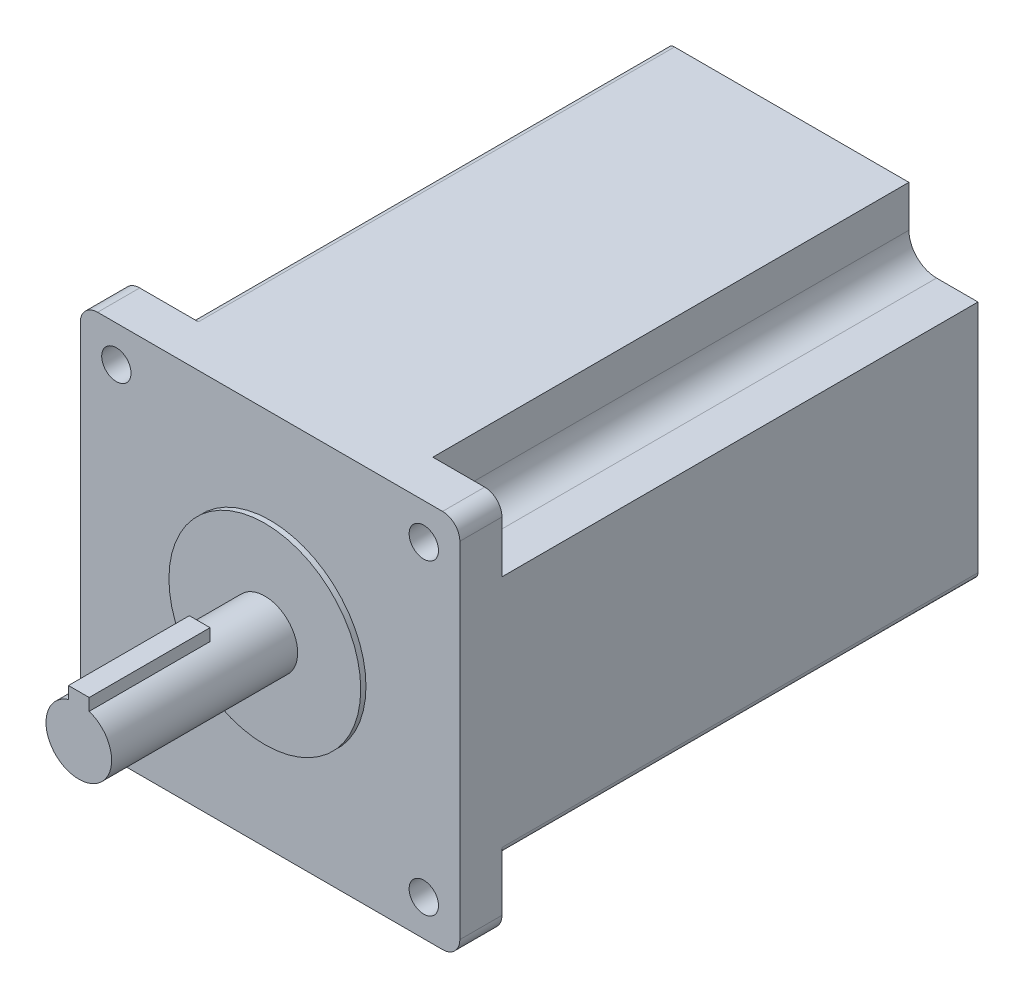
ISO-10303-21;
HEADER;
FILE_DESCRIPTION(('STEP AP214'),'2;1');
FILE_NAME('part.step','',(''),(''),'','','');
FILE_SCHEMA(('AUTOMOTIVE_DESIGN { 1 0 10303 214 1 1 1 1 }'));
ENDSEC;
DATA;
#1=APPLICATION_CONTEXT('core data for automotive mechanical design processes');
#2=APPLICATION_PROTOCOL_DEFINITION('international standard','automotive_design',2000,#1);
#3=PRODUCT_CONTEXT('',#1,'mechanical');
#4=PRODUCT('Part','Part','',(#3));
#5=PRODUCT_RELATED_PRODUCT_CATEGORY('part','',(#4));
#6=PRODUCT_DEFINITION_FORMATION('','',#4);
#7=PRODUCT_DEFINITION_CONTEXT('part definition',#1,'design');
#8=PRODUCT_DEFINITION('design','',#6,#7);
#9=PRODUCT_DEFINITION_SHAPE('','',#8);
#10=(LENGTH_UNIT() NAMED_UNIT(*) SI_UNIT(.MILLI.,.METRE.));
#11=(NAMED_UNIT(*) PLANE_ANGLE_UNIT() SI_UNIT($,.RADIAN.));
#12=(NAMED_UNIT(*) SI_UNIT($,.STERADIAN.) SOLID_ANGLE_UNIT());
#13=UNCERTAINTY_MEASURE_WITH_UNIT(LENGTH_MEASURE(1.E-05),#10,'distance_accuracy_value','');
#14=(GEOMETRIC_REPRESENTATION_CONTEXT(3) GLOBAL_UNCERTAINTY_ASSIGNED_CONTEXT((#13)) GLOBAL_UNIT_ASSIGNED_CONTEXT((#10,
#11,#12)) REPRESENTATION_CONTEXT('',''));
#15=CARTESIAN_POINT('',(0.,0.,0.));
#16=DIRECTION('',(0.,0.,1.));
#17=DIRECTION('',(1.,0.,0.));
#18=AXIS2_PLACEMENT_3D('',#15,#16,#17);
#19=CARTESIAN_POINT('',(29.0269690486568,-33.0397914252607,151.52));
#20=DIRECTION('',(0.,0.,1.));
#21=DIRECTION('',(1.,0.,0.));
#22=AXIS2_PLACEMENT_3D('',#19,#20,#21);
#23=PLANE('',#22);
#24=CARTESIAN_POINT('',(29.0269690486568,-33.0397914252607,151.52));
#25=DIRECTION('',(0.,0.,1.));
#26=DIRECTION('',(1.,0.,0.));
#27=AXIS2_PLACEMENT_3D('',#24,#25,#26);
#28=CIRCLE('',#27,27.76);
#29=CARTESIAN_POINT('',(56.7869690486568,-33.0397914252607,151.52));
#30=VERTEX_POINT('',#29);
#31=EDGE_CURVE('E298',#30,#30,#28,.T.);
#32=ORIENTED_EDGE('',*,*,#31,.T.);
#33=EDGE_LOOP('',(#32));
#34=FACE_BOUND('',#33,.T.);
#35=CARTESIAN_POINT('',(29.0269690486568,-33.0397914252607,151.52));
#36=DIRECTION('',(0.,0.,1.));
#37=DIRECTION('',(1.,0.,0.));
#38=AXIS2_PLACEMENT_3D('',#35,#36,#37);
#39=CIRCLE('',#38,9.5);
#40=CARTESIAN_POINT('',(38.5269690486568,-33.0397914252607,151.52));
#41=VERTEX_POINT('',#40);
#42=EDGE_CURVE('E291',#41,#41,#39,.T.);
#43=ORIENTED_EDGE('',*,*,#42,.F.);
#44=EDGE_LOOP('',(#43));
#45=FACE_BOUND('',#44,.T.);
#46=ADVANCED_FACE('F31',(#34,#45),#23,.T.);
#47=CARTESIAN_POINT('',(-25.9030309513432,-87.9697914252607,150.));
#48=DIRECTION('',(0.,0.,1.));
#49=DIRECTION('',(1.,0.,0.));
#50=AXIS2_PLACEMENT_3D('',#47,#48,#49);
#51=PLANE('',#50);
#52=CARTESIAN_POINT('',(73.5269690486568,-77.5397914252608,150.));
#53=DIRECTION('',(0.,0.,1.));
#54=DIRECTION('',(1.,0.,0.));
#55=AXIS2_PLACEMENT_3D('',#52,#53,#54);
#56=CIRCLE('',#55,4.25000000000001);
#57=CARTESIAN_POINT('',(77.7769690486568,-77.5397914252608,150.));
#58=VERTEX_POINT('',#57);
#59=EDGE_CURVE('E544',#58,#58,#56,.T.);
#60=ORIENTED_EDGE('',*,*,#59,.F.);
#61=EDGE_LOOP('',(#60));
#62=FACE_BOUND('',#61,.T.);
#63=CARTESIAN_POINT('',(-15.4730309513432,-77.5397914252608,150.));
#64=DIRECTION('',(0.,0.,1.));
#65=DIRECTION('',(1.,0.,0.));
#66=AXIS2_PLACEMENT_3D('',#63,#64,#65);
#67=CIRCLE('',#66,4.25);
#68=CARTESIAN_POINT('',(-11.2230309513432,-77.5397914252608,150.));
#69=VERTEX_POINT('',#68);
#70=EDGE_CURVE('E534',#69,#69,#67,.T.);
#71=ORIENTED_EDGE('',*,*,#70,.F.);
#72=EDGE_LOOP('',(#71));
#73=FACE_BOUND('',#72,.T.);
#74=CARTESIAN_POINT('',(73.5269690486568,11.4602085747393,150.));
#75=DIRECTION('',(0.,0.,1.));
#76=DIRECTION('',(1.,0.,0.));
#77=AXIS2_PLACEMENT_3D('',#74,#75,#76);
#78=CIRCLE('',#77,4.25000000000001);
#79=CARTESIAN_POINT('',(77.7769690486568,11.4602085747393,150.));
#80=VERTEX_POINT('',#79);
#81=EDGE_CURVE('E531',#80,#80,#78,.T.);
#82=ORIENTED_EDGE('',*,*,#81,.F.);
#83=EDGE_LOOP('',(#82));
#84=FACE_BOUND('',#83,.T.);
#85=CARTESIAN_POINT('',(-15.4730309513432,11.4602085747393,150.));
#86=DIRECTION('',(0.,0.,1.));
#87=DIRECTION('',(1.,0.,0.));
#88=AXIS2_PLACEMENT_3D('',#85,#86,#87);
#89=CIRCLE('',#88,4.25);
#90=CARTESIAN_POINT('',(-11.2230309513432,11.4602085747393,150.));
#91=VERTEX_POINT('',#90);
#92=EDGE_CURVE('E528',#91,#91,#89,.T.);
#93=ORIENTED_EDGE('',*,*,#92,.F.);
#94=EDGE_LOOP('',(#93));
#95=FACE_BOUND('',#94,.T.);
#96=DIRECTION('',(-1.,0.,0.));
#97=VECTOR('',#96,1.);
#98=CARTESIAN_POINT('',(-25.9030309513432,21.8902085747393,150.));
#99=LINE('',#98,#97);
#100=CARTESIAN_POINT('',(78.9569690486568,21.8902085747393,150.));
#101=VERTEX_POINT('',#100);
#102=CARTESIAN_POINT('',(-20.9030309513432,21.8902085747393,150.));
#103=VERTEX_POINT('',#102);
#104=EDGE_CURVE('E378',#101,#103,#99,.T.);
#105=ORIENTED_EDGE('',*,*,#104,.T.);
#106=CARTESIAN_POINT('',(-20.9030309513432,16.8902085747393,150.));
#107=DIRECTION('',(0.,0.,1.));
#108=DIRECTION('',(1.,0.,0.));
#109=AXIS2_PLACEMENT_3D('',#106,#107,#108);
#110=CIRCLE('',#109,5.);
#111=CARTESIAN_POINT('',(-25.9030309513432,16.8902085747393,150.));
#112=VERTEX_POINT('',#111);
#113=EDGE_CURVE('E410',#103,#112,#110,.T.);
#114=ORIENTED_EDGE('',*,*,#113,.T.);
#115=DIRECTION('',(0.,-1.,0.));
#116=VECTOR('',#115,1.);
#117=CARTESIAN_POINT('',(-25.9030309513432,21.8902085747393,150.));
#118=LINE('',#117,#116);
#119=CARTESIAN_POINT('',(-25.9030309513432,-82.9697914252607,150.));
#120=VERTEX_POINT('',#119);
#121=EDGE_CURVE('E368',#112,#120,#118,.T.);
#122=ORIENTED_EDGE('',*,*,#121,.T.);
#123=CARTESIAN_POINT('',(-20.9030309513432,-82.9697914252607,150.));
#124=DIRECTION('',(0.,0.,1.));
#125=DIRECTION('',(1.,0.,0.));
#126=AXIS2_PLACEMENT_3D('',#123,#124,#125);
#127=CIRCLE('',#126,5.);
#128=CARTESIAN_POINT('',(-20.9030309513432,-87.9697914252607,150.));
#129=VERTEX_POINT('',#128);
#130=EDGE_CURVE('E408',#120,#129,#127,.T.);
#131=ORIENTED_EDGE('',*,*,#130,.T.);
#132=DIRECTION('',(1.,0.,0.));
#133=VECTOR('',#132,1.);
#134=CARTESIAN_POINT('',(-25.9030309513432,-87.9697914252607,150.));
#135=LINE('',#134,#133);
#136=CARTESIAN_POINT('',(78.9569690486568,-87.9697914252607,150.));
#137=VERTEX_POINT('',#136);
#138=EDGE_CURVE('E371',#129,#137,#135,.T.);
#139=ORIENTED_EDGE('',*,*,#138,.T.);
#140=CARTESIAN_POINT('',(78.9569690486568,-82.9697914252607,150.));
#141=DIRECTION('',(0.,0.,1.));
#142=DIRECTION('',(1.,0.,0.));
#143=AXIS2_PLACEMENT_3D('',#140,#141,#142);
#144=CIRCLE('',#143,5.);
#145=CARTESIAN_POINT('',(83.9569690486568,-82.9697914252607,150.));
#146=VERTEX_POINT('',#145);
#147=EDGE_CURVE('E406',#137,#146,#144,.T.);
#148=ORIENTED_EDGE('',*,*,#147,.T.);
#149=DIRECTION('',(0.,1.,0.));
#150=VECTOR('',#149,1.);
#151=CARTESIAN_POINT('',(83.9569690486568,21.8902085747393,150.));
#152=LINE('',#151,#150);
#153=CARTESIAN_POINT('',(83.9569690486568,16.8902085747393,150.));
#154=VERTEX_POINT('',#153);
#155=EDGE_CURVE('E375',#146,#154,#152,.T.);
#156=ORIENTED_EDGE('',*,*,#155,.T.);
#157=CARTESIAN_POINT('',(78.9569690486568,16.8902085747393,150.));
#158=DIRECTION('',(0.,0.,1.));
#159=DIRECTION('',(1.,0.,0.));
#160=AXIS2_PLACEMENT_3D('',#157,#158,#159);
#161=CIRCLE('',#160,5.);
#162=EDGE_CURVE('E404',#154,#101,#161,.T.);
#163=ORIENTED_EDGE('',*,*,#162,.T.);
#164=EDGE_LOOP('',(#105,#114,#122,#131,#139,#148,#156,#163));
#165=FACE_BOUND('',#164,.T.);
#166=CARTESIAN_POINT('',(29.0269690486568,-33.0397914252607,150.));
#167=DIRECTION('',(0.,0.,1.));
#168=DIRECTION('',(1.,0.,0.));
#169=AXIS2_PLACEMENT_3D('',#166,#167,#168);
#170=CIRCLE('',#169,27.76);
#171=CARTESIAN_POINT('',(56.7869690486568,-33.0397914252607,150.));
#172=VERTEX_POINT('',#171);
#173=EDGE_CURVE('E295',#172,#172,#170,.T.);
#174=ORIENTED_EDGE('',*,*,#173,.F.);
#175=EDGE_LOOP('',(#174));
#176=FACE_BOUND('',#175,.T.);
#177=ADVANCED_FACE('F569',(#62,#73,#84,#95,#165,#176),#51,.T.);
#178=CARTESIAN_POINT('',(-25.9030309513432,21.8902085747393,150.));
#179=DIRECTION('',(1.,0.,0.));
#180=DIRECTION('',(0.,0.,-1.));
#181=AXIS2_PLACEMENT_3D('',#178,#179,#180);
#182=PLANE('',#181);
#183=DIRECTION('',(0.,-1.,0.));
#184=VECTOR('',#183,1.);
#185=CARTESIAN_POINT('',(-25.9030309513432,21.8902085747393,0.));
#186=LINE('',#185,#184);
#187=CARTESIAN_POINT('',(-25.9030309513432,-0.109791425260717,0.));
#188=VERTEX_POINT('',#187);
#189=CARTESIAN_POINT('',(-25.9030309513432,-65.9697914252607,0.));
#190=VERTEX_POINT('',#189);
#191=EDGE_CURVE('E365',#188,#190,#186,.T.);
#192=ORIENTED_EDGE('',*,*,#191,.T.);
#193=DIRECTION('',(0.,0.,-1.));
#194=VECTOR('',#193,1.);
#195=CARTESIAN_POINT('',(-25.9030309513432,-65.9697914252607,150.));
#196=LINE('',#195,#194);
#197=CARTESIAN_POINT('',(-25.9030309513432,-65.9697914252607,137.81));
#198=VERTEX_POINT('',#197);
#199=EDGE_CURVE('E467',#190,#198,#196,.F.);
#200=ORIENTED_EDGE('',*,*,#199,.T.);
#201=DIRECTION('',(0.,1.,0.));
#202=VECTOR('',#201,1.);
#203=CARTESIAN_POINT('',(-25.9030309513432,-87.9697914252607,137.81));
#204=LINE('',#203,#202);
#205=CARTESIAN_POINT('',(-25.9030309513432,-82.9697914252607,137.81));
#206=VERTEX_POINT('',#205);
#207=EDGE_CURVE('E319',#206,#198,#204,.T.);
#208=ORIENTED_EDGE('',*,*,#207,.F.);
#209=DIRECTION('',(0.,0.,-1.));
#210=VECTOR('',#209,1.);
#211=CARTESIAN_POINT('',(-25.9030309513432,-82.9697914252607,150.));
#212=LINE('',#211,#210);
#213=EDGE_CURVE('E392',#206,#120,#212,.F.);
#214=ORIENTED_EDGE('',*,*,#213,.T.);
#215=ORIENTED_EDGE('',*,*,#121,.F.);
#216=DIRECTION('',(0.,0.,-1.));
#217=VECTOR('',#216,1.);
#218=CARTESIAN_POINT('',(-25.9030309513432,16.8902085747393,150.));
#219=LINE('',#218,#217);
#220=CARTESIAN_POINT('',(-25.9030309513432,16.8902085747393,137.81));
#221=VERTEX_POINT('',#220);
#222=EDGE_CURVE('E394',#112,#221,#219,.T.);
#223=ORIENTED_EDGE('',*,*,#222,.T.);
#224=DIRECTION('',(0.,1.,0.));
#225=VECTOR('',#224,1.);
#226=CARTESIAN_POINT('',(-25.9030309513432,21.8902085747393,137.81));
#227=LINE('',#226,#225);
#228=CARTESIAN_POINT('',(-25.9030309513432,-0.109791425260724,137.81));
#229=VERTEX_POINT('',#228);
#230=EDGE_CURVE('E334',#229,#221,#227,.T.);
#231=ORIENTED_EDGE('',*,*,#230,.F.);
#232=DIRECTION('',(0.,0.,-1.));
#233=VECTOR('',#232,1.);
#234=CARTESIAN_POINT('',(-25.9030309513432,-0.109791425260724,150.));
#235=LINE('',#234,#233);
#236=EDGE_CURVE('E464',#229,#188,#235,.T.);
#237=ORIENTED_EDGE('',*,*,#236,.T.);
#238=EDGE_LOOP('',(#192,#200,#208,#214,#215,#223,#231,#237));
#239=FACE_BOUND('',#238,.T.);
#240=ADVANCED_FACE('F575',(#239),#182,.F.);
#241=CARTESIAN_POINT('',(-25.9030309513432,-87.9697914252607,150.));
#242=DIRECTION('',(0.,1.,0.));
#243=DIRECTION('',(0.,0.,1.));
#244=AXIS2_PLACEMENT_3D('',#241,#242,#243);
#245=PLANE('',#244);
#246=DIRECTION('',(1.,0.,0.));
#247=VECTOR('',#246,1.);
#248=CARTESIAN_POINT('',(-25.9030309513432,-87.9697914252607,0.));
#249=LINE('',#248,#247);
#250=CARTESIAN_POINT('',(-3.9030309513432,-87.9697914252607,0.));
#251=VERTEX_POINT('',#250);
#252=CARTESIAN_POINT('',(61.9569690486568,-87.9697914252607,0.));
#253=VERTEX_POINT('',#252);
#254=EDGE_CURVE('E384',#251,#253,#249,.T.);
#255=ORIENTED_EDGE('',*,*,#254,.T.);
#256=DIRECTION('',(0.,0.,-1.));
#257=VECTOR('',#256,1.);
#258=CARTESIAN_POINT('',(61.9569690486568,-87.9697914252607,150.));
#259=LINE('',#258,#257);
#260=CARTESIAN_POINT('',(61.9569690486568,-87.9697914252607,137.81));
#261=VERTEX_POINT('',#260);
#262=EDGE_CURVE('E455',#253,#261,#259,.F.);
#263=ORIENTED_EDGE('',*,*,#262,.T.);
#264=DIRECTION('',(-1.,0.,0.));
#265=VECTOR('',#264,1.);
#266=CARTESIAN_POINT('',(83.9569690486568,-87.9697914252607,137.81));
#267=LINE('',#266,#265);
#268=CARTESIAN_POINT('',(78.9569690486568,-87.9697914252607,137.81));
#269=VERTEX_POINT('',#268);
#270=EDGE_CURVE('E307',#269,#261,#267,.T.);
#271=ORIENTED_EDGE('',*,*,#270,.F.);
#272=DIRECTION('',(0.,0.,-1.));
#273=VECTOR('',#272,1.);
#274=CARTESIAN_POINT('',(78.9569690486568,-87.9697914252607,150.));
#275=LINE('',#274,#273);
#276=EDGE_CURVE('E412',#269,#137,#275,.F.);
#277=ORIENTED_EDGE('',*,*,#276,.T.);
#278=ORIENTED_EDGE('',*,*,#138,.F.);
#279=DIRECTION('',(0.,0.,-1.));
#280=VECTOR('',#279,1.);
#281=CARTESIAN_POINT('',(-20.9030309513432,-87.9697914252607,150.));
#282=LINE('',#281,#280);
#283=CARTESIAN_POINT('',(-20.9030309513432,-87.9697914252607,137.81));
#284=VERTEX_POINT('',#283);
#285=EDGE_CURVE('E414',#129,#284,#282,.T.);
#286=ORIENTED_EDGE('',*,*,#285,.T.);
#287=DIRECTION('',(-1.,0.,0.));
#288=VECTOR('',#287,1.);
#289=CARTESIAN_POINT('',(-25.9030309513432,-87.9697914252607,137.81));
#290=LINE('',#289,#288);
#291=CARTESIAN_POINT('',(-3.90303095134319,-87.9697914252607,137.81));
#292=VERTEX_POINT('',#291);
#293=EDGE_CURVE('E327',#292,#284,#290,.T.);
#294=ORIENTED_EDGE('',*,*,#293,.F.);
#295=DIRECTION('',(0.,0.,-1.));
#296=VECTOR('',#295,1.);
#297=CARTESIAN_POINT('',(-3.90303095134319,-87.9697914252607,150.));
#298=LINE('',#297,#296);
#299=EDGE_CURVE('E452',#292,#251,#298,.T.);
#300=ORIENTED_EDGE('',*,*,#299,.T.);
#301=EDGE_LOOP('',(#255,#263,#271,#277,#278,#286,#294,#300));
#302=FACE_BOUND('',#301,.T.);
#303=ADVANCED_FACE('F640',(#302),#245,.F.);
#304=CARTESIAN_POINT('',(83.9569690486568,21.8902085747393,150.));
#305=DIRECTION('',(-1.,0.,0.));
#306=DIRECTION('',(0.,-1.,0.));
#307=AXIS2_PLACEMENT_3D('',#304,#305,#306);
#308=PLANE('',#307);
#309=DIRECTION('',(0.,-1.,0.));
#310=VECTOR('',#309,1.);
#311=CARTESIAN_POINT('',(83.9569690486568,-87.9697914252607,137.81));
#312=LINE('',#311,#310);
#313=CARTESIAN_POINT('',(83.9569690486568,-65.9697914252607,137.81));
#314=VERTEX_POINT('',#313);
#315=CARTESIAN_POINT('',(83.9569690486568,-82.9697914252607,137.81));
#316=VERTEX_POINT('',#315);
#317=EDGE_CURVE('E304',#314,#316,#312,.T.);
#318=ORIENTED_EDGE('',*,*,#317,.F.);
#319=DIRECTION('',(0.,0.,-1.));
#320=VECTOR('',#319,1.);
#321=CARTESIAN_POINT('',(83.9569690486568,-65.9697914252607,150.));
#322=LINE('',#321,#320);
#323=CARTESIAN_POINT('',(83.9569690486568,-65.9697914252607,0.));
#324=VERTEX_POINT('',#323);
#325=EDGE_CURVE('E428',#314,#324,#322,.T.);
#326=ORIENTED_EDGE('',*,*,#325,.T.);
#327=DIRECTION('',(0.,1.,0.));
#328=VECTOR('',#327,1.);
#329=CARTESIAN_POINT('',(83.9569690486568,21.8902085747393,0.));
#330=LINE('',#329,#328);
#331=CARTESIAN_POINT('',(83.9569690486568,1.89020857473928,0.));
#332=VERTEX_POINT('',#331);
#333=EDGE_CURVE('E387',#324,#332,#330,.T.);
#334=ORIENTED_EDGE('',*,*,#333,.T.);
#335=DIRECTION('',(0.,0.,-1.));
#336=VECTOR('',#335,1.);
#337=CARTESIAN_POINT('',(83.9569690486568,1.89020857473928,137.81));
#338=LINE('',#337,#336);
#339=CARTESIAN_POINT('',(83.9569690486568,1.89020857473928,137.81));
#340=VERTEX_POINT('',#339);
#341=EDGE_CURVE('E359',#340,#332,#338,.T.);
#342=ORIENTED_EDGE('',*,*,#341,.F.);
#343=DIRECTION('',(0.,-1.,0.));
#344=VECTOR('',#343,1.);
#345=CARTESIAN_POINT('',(83.9569690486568,21.8902085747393,137.81));
#346=LINE('',#345,#344);
#347=CARTESIAN_POINT('',(83.9569690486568,16.8902085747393,137.81));
#348=VERTEX_POINT('',#347);
#349=EDGE_CURVE('E349',#348,#340,#346,.T.);
#350=ORIENTED_EDGE('',*,*,#349,.F.);
#351=DIRECTION('',(0.,0.,-1.));
#352=VECTOR('',#351,1.);
#353=CARTESIAN_POINT('',(83.9569690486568,16.8902085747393,150.));
#354=LINE('',#353,#352);
#355=EDGE_CURVE('E419',#348,#154,#354,.F.);
#356=ORIENTED_EDGE('',*,*,#355,.T.);
#357=ORIENTED_EDGE('',*,*,#155,.F.);
#358=DIRECTION('',(0.,0.,-1.));
#359=VECTOR('',#358,1.);
#360=CARTESIAN_POINT('',(83.9569690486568,-82.9697914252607,150.));
#361=LINE('',#360,#359);
#362=EDGE_CURVE('E421',#146,#316,#361,.T.);
#363=ORIENTED_EDGE('',*,*,#362,.T.);
#364=EDGE_LOOP('',(#318,#326,#334,#342,#350,#356,#357,#363));
#365=FACE_BOUND('',#364,.T.);
#366=ADVANCED_FACE('F636',(#365),#308,.F.);
#367=CARTESIAN_POINT('',(-25.9030309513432,21.8902085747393,150.));
#368=DIRECTION('',(0.,-1.,0.));
#369=DIRECTION('',(0.,0.,-1.));
#370=AXIS2_PLACEMENT_3D('',#367,#368,#369);
#371=PLANE('',#370);
#372=DIRECTION('',(-1.,0.,0.));
#373=VECTOR('',#372,1.);
#374=CARTESIAN_POINT('',(-25.9030309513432,21.8902085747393,0.));
#375=LINE('',#374,#373);
#376=CARTESIAN_POINT('',(63.9569690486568,21.8902085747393,0.));
#377=VERTEX_POINT('',#376);
#378=CARTESIAN_POINT('',(-3.90303095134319,21.8902085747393,0.));
#379=VERTEX_POINT('',#378);
#380=EDGE_CURVE('E372',#377,#379,#375,.T.);
#381=ORIENTED_EDGE('',*,*,#380,.T.);
#382=DIRECTION('',(0.,0.,-1.));
#383=VECTOR('',#382,1.);
#384=CARTESIAN_POINT('',(-3.90303095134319,21.8902085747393,150.));
#385=LINE('',#384,#383);
#386=CARTESIAN_POINT('',(-3.90303095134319,21.8902085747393,137.81));
#387=VERTEX_POINT('',#386);
#388=EDGE_CURVE('E476',#379,#387,#385,.F.);
#389=ORIENTED_EDGE('',*,*,#388,.T.);
#390=DIRECTION('',(1.,0.,0.));
#391=VECTOR('',#390,1.);
#392=CARTESIAN_POINT('',(-25.9030309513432,21.8902085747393,137.81));
#393=LINE('',#392,#391);
#394=CARTESIAN_POINT('',(-20.9030309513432,21.8902085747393,137.81));
#395=VERTEX_POINT('',#394);
#396=EDGE_CURVE('E337',#395,#387,#393,.T.);
#397=ORIENTED_EDGE('',*,*,#396,.F.);
#398=DIRECTION('',(0.,0.,-1.));
#399=VECTOR('',#398,1.);
#400=CARTESIAN_POINT('',(-20.9030309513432,21.8902085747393,150.));
#401=LINE('',#400,#399);
#402=EDGE_CURVE('E402',#395,#103,#401,.F.);
#403=ORIENTED_EDGE('',*,*,#402,.T.);
#404=ORIENTED_EDGE('',*,*,#104,.F.);
#405=DIRECTION('',(0.,0.,-1.));
#406=VECTOR('',#405,1.);
#407=CARTESIAN_POINT('',(78.9569690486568,21.8902085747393,150.));
#408=LINE('',#407,#406);
#409=CARTESIAN_POINT('',(78.9569690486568,21.8902085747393,137.81));
#410=VERTEX_POINT('',#409);
#411=EDGE_CURVE('E399',#101,#410,#408,.T.);
#412=ORIENTED_EDGE('',*,*,#411,.T.);
#413=DIRECTION('',(1.,0.,0.));
#414=VECTOR('',#413,1.);
#415=CARTESIAN_POINT('',(83.9569690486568,21.8902085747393,137.81));
#416=LINE('',#415,#414);
#417=CARTESIAN_POINT('',(63.9569690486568,21.8902085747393,137.81));
#418=VERTEX_POINT('',#417);
#419=EDGE_CURVE('E356',#418,#410,#416,.T.);
#420=ORIENTED_EDGE('',*,*,#419,.F.);
#421=DIRECTION('',(0.,0.,-1.));
#422=VECTOR('',#421,1.);
#423=CARTESIAN_POINT('',(63.9569690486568,21.8902085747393,137.81));
#424=LINE('',#423,#422);
#425=EDGE_CURVE('E362',#418,#377,#424,.T.);
#426=ORIENTED_EDGE('',*,*,#425,.T.);
#427=EDGE_LOOP('',(#381,#389,#397,#403,#404,#412,#420,#426));
#428=FACE_BOUND('',#427,.T.);
#429=ADVANCED_FACE('F633',(#428),#371,.F.);
#430=CARTESIAN_POINT('',(-25.9030309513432,-87.9697914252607,0.));
#431=DIRECTION('',(0.,0.,1.));
#432=DIRECTION('',(1.,0.,0.));
#433=AXIS2_PLACEMENT_3D('',#430,#431,#432);
#434=PLANE('',#433);
#435=ORIENTED_EDGE('',*,*,#333,.F.);
#436=CARTESIAN_POINT('',(81.9569690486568,-65.9697914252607,0.));
#437=DIRECTION('',(0.,0.,1.));
#438=DIRECTION('',(1.,0.,0.));
#439=AXIS2_PLACEMENT_3D('',#436,#437,#438);
#440=CIRCLE('',#439,2.);
#441=CARTESIAN_POINT('',(81.9569690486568,-67.9697914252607,0.));
#442=VERTEX_POINT('',#441);
#443=EDGE_CURVE('E443',#324,#442,#440,.F.);
#444=ORIENTED_EDGE('',*,*,#443,.T.);
#445=DIRECTION('',(1.,0.,0.));
#446=VECTOR('',#445,1.);
#447=CARTESIAN_POINT('',(83.9569690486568,-67.9697914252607,0.));
#448=LINE('',#447,#446);
#449=CARTESIAN_POINT('',(71.9569690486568,-67.9697914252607,0.));
#450=VERTEX_POINT('',#449);
#451=EDGE_CURVE('E308',#450,#442,#448,.T.);
#452=ORIENTED_EDGE('',*,*,#451,.F.);
#453=CARTESIAN_POINT('',(71.9569690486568,-75.9697914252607,0.));
#454=DIRECTION('',(0.,0.,1.));
#455=DIRECTION('',(1.,0.,0.));
#456=AXIS2_PLACEMENT_3D('',#453,#454,#455);
#457=CIRCLE('',#456,8.);
#458=CARTESIAN_POINT('',(63.9569690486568,-75.9697914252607,0.));
#459=VERTEX_POINT('',#458);
#460=EDGE_CURVE('E521',#450,#459,#457,.T.);
#461=ORIENTED_EDGE('',*,*,#460,.T.);
#462=DIRECTION('',(0.,1.,0.));
#463=VECTOR('',#462,1.);
#464=CARTESIAN_POINT('',(63.9569690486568,-87.9697914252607,0.));
#465=LINE('',#464,#463);
#466=CARTESIAN_POINT('',(63.9569690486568,-85.9697914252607,0.));
#467=VERTEX_POINT('',#466);
#468=EDGE_CURVE('E301',#467,#459,#465,.T.);
#469=ORIENTED_EDGE('',*,*,#468,.F.);
#470=CARTESIAN_POINT('',(61.9569690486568,-85.9697914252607,0.));
#471=DIRECTION('',(0.,0.,1.));
#472=DIRECTION('',(1.,0.,0.));
#473=AXIS2_PLACEMENT_3D('',#470,#471,#472);
#474=CIRCLE('',#473,2.);
#475=EDGE_CURVE('E441',#467,#253,#474,.F.);
#476=ORIENTED_EDGE('',*,*,#475,.T.);
#477=ORIENTED_EDGE('',*,*,#254,.F.);
#478=CARTESIAN_POINT('',(-3.90303095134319,-85.9697914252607,0.));
#479=DIRECTION('',(0.,0.,1.));
#480=DIRECTION('',(1.,0.,0.));
#481=AXIS2_PLACEMENT_3D('',#478,#479,#480);
#482=CIRCLE('',#481,2.);
#483=CARTESIAN_POINT('',(-5.90303095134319,-85.9697914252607,0.));
#484=VERTEX_POINT('',#483);
#485=EDGE_CURVE('E438',#251,#484,#482,.F.);
#486=ORIENTED_EDGE('',*,*,#485,.T.);
#487=DIRECTION('',(0.,-1.,0.));
#488=VECTOR('',#487,1.);
#489=CARTESIAN_POINT('',(-5.90303095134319,-87.9697914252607,0.));
#490=LINE('',#489,#488);
#491=CARTESIAN_POINT('',(-5.90303095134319,-75.9697914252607,0.));
#492=VERTEX_POINT('',#491);
#493=EDGE_CURVE('E322',#492,#484,#490,.T.);
#494=ORIENTED_EDGE('',*,*,#493,.F.);
#495=CARTESIAN_POINT('',(-13.9030309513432,-75.9697914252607,0.));
#496=DIRECTION('',(0.,0.,1.));
#497=DIRECTION('',(1.,0.,0.));
#498=AXIS2_PLACEMENT_3D('',#495,#496,#497);
#499=CIRCLE('',#498,8.);
#500=CARTESIAN_POINT('',(-13.9030309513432,-67.9697914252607,0.));
#501=VERTEX_POINT('',#500);
#502=EDGE_CURVE('E40',#492,#501,#499,.T.);
#503=ORIENTED_EDGE('',*,*,#502,.T.);
#504=DIRECTION('',(1.,0.,0.));
#505=VECTOR('',#504,1.);
#506=CARTESIAN_POINT('',(-25.9030309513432,-67.9697914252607,0.));
#507=LINE('',#506,#505);
#508=CARTESIAN_POINT('',(-23.9030309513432,-67.9697914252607,0.));
#509=VERTEX_POINT('',#508);
#510=EDGE_CURVE('E315',#509,#501,#507,.T.);
#511=ORIENTED_EDGE('',*,*,#510,.F.);
#512=CARTESIAN_POINT('',(-23.9030309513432,-65.9697914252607,0.));
#513=DIRECTION('',(0.,0.,1.));
#514=DIRECTION('',(1.,0.,0.));
#515=AXIS2_PLACEMENT_3D('',#512,#513,#514);
#516=CIRCLE('',#515,2.);
#517=EDGE_CURVE('E436',#509,#190,#516,.F.);
#518=ORIENTED_EDGE('',*,*,#517,.T.);
#519=ORIENTED_EDGE('',*,*,#191,.F.);
#520=CARTESIAN_POINT('',(-23.9030309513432,-0.109791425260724,0.));
#521=DIRECTION('',(0.,0.,1.));
#522=DIRECTION('',(1.,0.,0.));
#523=AXIS2_PLACEMENT_3D('',#520,#521,#522);
#524=CIRCLE('',#523,2.);
#525=CARTESIAN_POINT('',(-23.9030309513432,1.89020857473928,0.));
#526=VERTEX_POINT('',#525);
#527=EDGE_CURVE('E433',#188,#526,#524,.F.);
#528=ORIENTED_EDGE('',*,*,#527,.T.);
#529=DIRECTION('',(-1.,0.,0.));
#530=VECTOR('',#529,1.);
#531=CARTESIAN_POINT('',(-25.9030309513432,1.89020857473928,0.));
#532=LINE('',#531,#530);
#533=CARTESIAN_POINT('',(-13.9030309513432,1.89020857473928,0.));
#534=VERTEX_POINT('',#533);
#535=EDGE_CURVE('E338',#534,#526,#532,.T.);
#536=ORIENTED_EDGE('',*,*,#535,.F.);
#537=CARTESIAN_POINT('',(-13.9030309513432,9.89020857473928,0.));
#538=DIRECTION('',(0.,0.,1.));
#539=DIRECTION('',(1.,0.,0.));
#540=AXIS2_PLACEMENT_3D('',#537,#538,#539);
#541=CIRCLE('',#540,8.);
#542=CARTESIAN_POINT('',(-5.90303095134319,9.89020857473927,0.));
#543=VERTEX_POINT('',#542);
#544=EDGE_CURVE('E523',#534,#543,#541,.T.);
#545=ORIENTED_EDGE('',*,*,#544,.T.);
#546=DIRECTION('',(0.,-1.,0.));
#547=VECTOR('',#546,1.);
#548=CARTESIAN_POINT('',(-5.90303095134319,21.8902085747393,0.));
#549=LINE('',#548,#547);
#550=CARTESIAN_POINT('',(-5.90303095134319,19.8902085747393,0.));
#551=VERTEX_POINT('',#550);
#552=EDGE_CURVE('E330',#551,#543,#549,.T.);
#553=ORIENTED_EDGE('',*,*,#552,.F.);
#554=CARTESIAN_POINT('',(-3.90303095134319,19.8902085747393,0.));
#555=DIRECTION('',(0.,0.,1.));
#556=DIRECTION('',(1.,0.,0.));
#557=AXIS2_PLACEMENT_3D('',#554,#555,#556);
#558=CIRCLE('',#557,2.);
#559=EDGE_CURVE('E431',#551,#379,#558,.F.);
#560=ORIENTED_EDGE('',*,*,#559,.T.);
#561=ORIENTED_EDGE('',*,*,#380,.F.);
#562=DIRECTION('',(0.,1.,0.));
#563=VECTOR('',#562,1.);
#564=CARTESIAN_POINT('',(63.9569690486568,21.8902085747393,0.));
#565=LINE('',#564,#563);
#566=CARTESIAN_POINT('',(63.9569690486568,9.89020857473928,0.));
#567=VERTEX_POINT('',#566);
#568=EDGE_CURVE('E352',#567,#377,#565,.T.);
#569=ORIENTED_EDGE('',*,*,#568,.F.);
#570=CARTESIAN_POINT('',(71.9569690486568,9.89020857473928,0.));
#571=DIRECTION('',(0.,0.,1.));
#572=DIRECTION('',(1.,0.,0.));
#573=AXIS2_PLACEMENT_3D('',#570,#571,#572);
#574=CIRCLE('',#573,8.);
#575=CARTESIAN_POINT('',(71.9569690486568,1.89020857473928,0.));
#576=VERTEX_POINT('',#575);
#577=EDGE_CURVE('E11',#567,#576,#574,.T.);
#578=ORIENTED_EDGE('',*,*,#577,.T.);
#579=DIRECTION('',(-1.,0.,0.));
#580=VECTOR('',#579,1.);
#581=CARTESIAN_POINT('',(83.9569690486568,1.89020857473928,0.));
#582=LINE('',#581,#580);
#583=EDGE_CURVE('E345',#332,#576,#582,.T.);
#584=ORIENTED_EDGE('',*,*,#583,.F.);
#585=EDGE_LOOP('',(#435,#444,#452,#461,#469,#476,#477,#486,#494,#503,#511,#518,#519,#528,#536,
#545,#553,#560,#561,#569,#578,#584));
#586=FACE_BOUND('',#585,.T.);
#587=ADVANCED_FACE('F627',(#586),#434,.F.);
#588=CARTESIAN_POINT('',(63.9569690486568,21.8902085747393,137.81));
#589=DIRECTION('',(-1.,0.,0.));
#590=DIRECTION('',(0.,0.,1.));
#591=AXIS2_PLACEMENT_3D('',#588,#589,#590);
#592=PLANE('',#591);
#593=DIRECTION('',(0.,1.,0.));
#594=VECTOR('',#593,1.);
#595=CARTESIAN_POINT('',(63.9569690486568,21.8902085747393,137.81));
#596=LINE('',#595,#594);
#597=CARTESIAN_POINT('',(63.9569690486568,9.89020857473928,137.81));
#598=VERTEX_POINT('',#597);
#599=EDGE_CURVE('E354',#598,#418,#596,.T.);
#600=ORIENTED_EDGE('',*,*,#599,.F.);
#601=DIRECTION('',(0.,0.,-1.));
#602=VECTOR('',#601,1.);
#603=CARTESIAN_POINT('',(63.9569690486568,9.89020857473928,0.));
#604=LINE('',#603,#602);
#605=EDGE_CURVE('E515',#598,#567,#604,.T.);
#606=ORIENTED_EDGE('',*,*,#605,.T.);
#607=ORIENTED_EDGE('',*,*,#568,.T.);
#608=ORIENTED_EDGE('',*,*,#425,.F.);
#609=EDGE_LOOP('',(#600,#606,#607,#608));
#610=FACE_BOUND('',#609,.T.);
#611=ADVANCED_FACE('F624',(#610),#592,.F.);
#612=CARTESIAN_POINT('',(83.9569690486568,1.89020857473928,137.81));
#613=DIRECTION('',(0.,-1.,0.));
#614=DIRECTION('',(0.,0.,-1.));
#615=AXIS2_PLACEMENT_3D('',#612,#613,#614);
#616=PLANE('',#615);
#617=ORIENTED_EDGE('',*,*,#583,.T.);
#618=DIRECTION('',(0.,0.,-1.));
#619=VECTOR('',#618,1.);
#620=CARTESIAN_POINT('',(71.9569690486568,1.89020857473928,137.81));
#621=LINE('',#620,#619);
#622=CARTESIAN_POINT('',(71.9569690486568,1.89020857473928,137.81));
#623=VERTEX_POINT('',#622);
#624=EDGE_CURVE('E48',#576,#623,#621,.F.);
#625=ORIENTED_EDGE('',*,*,#624,.T.);
#626=DIRECTION('',(-1.,0.,0.));
#627=VECTOR('',#626,1.);
#628=CARTESIAN_POINT('',(83.9569690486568,1.89020857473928,137.81));
#629=LINE('',#628,#627);
#630=EDGE_CURVE('E351',#340,#623,#629,.T.);
#631=ORIENTED_EDGE('',*,*,#630,.F.);
#632=ORIENTED_EDGE('',*,*,#341,.T.);
#633=EDGE_LOOP('',(#617,#625,#631,#632));
#634=FACE_BOUND('',#633,.T.);
#635=ADVANCED_FACE('F622',(#634),#616,.F.);
#636=CARTESIAN_POINT('',(83.9569690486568,1.89020857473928,137.81));
#637=DIRECTION('',(0.,0.,-1.));
#638=DIRECTION('',(-1.,0.,0.));
#639=AXIS2_PLACEMENT_3D('',#636,#637,#638);
#640=PLANE('',#639);
#641=CARTESIAN_POINT('',(73.5269690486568,11.4602085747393,137.81));
#642=DIRECTION('',(0.,0.,-1.));
#643=DIRECTION('',(-1.,0.,0.));
#644=AXIS2_PLACEMENT_3D('',#641,#642,#643);
#645=CIRCLE('',#644,4.25000000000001);
#646=CARTESIAN_POINT('',(69.2769690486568,11.4602085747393,137.81));
#647=VERTEX_POINT('',#646);
#648=EDGE_CURVE('E529',#647,#647,#645,.T.);
#649=ORIENTED_EDGE('',*,*,#648,.F.);
#650=EDGE_LOOP('',(#649));
#651=FACE_BOUND('',#650,.T.);
#652=ORIENTED_EDGE('',*,*,#630,.T.);
#653=CARTESIAN_POINT('',(71.9569690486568,9.89020857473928,137.81));
#654=DIRECTION('',(0.,0.,-1.));
#655=DIRECTION('',(-1.,0.,0.));
#656=AXIS2_PLACEMENT_3D('',#653,#654,#655);
#657=CIRCLE('',#656,8.);
#658=EDGE_CURVE('E519',#623,#598,#657,.T.);
#659=ORIENTED_EDGE('',*,*,#658,.T.);
#660=ORIENTED_EDGE('',*,*,#599,.T.);
#661=ORIENTED_EDGE('',*,*,#419,.T.);
#662=CARTESIAN_POINT('',(78.9569690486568,16.8902085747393,137.81));
#663=DIRECTION('',(0.,0.,-1.));
#664=DIRECTION('',(-1.,0.,0.));
#665=AXIS2_PLACEMENT_3D('',#662,#663,#664);
#666=CIRCLE('',#665,5.);
#667=EDGE_CURVE('E426',#410,#348,#666,.T.);
#668=ORIENTED_EDGE('',*,*,#667,.T.);
#669=ORIENTED_EDGE('',*,*,#349,.T.);
#670=EDGE_LOOP('',(#652,#659,#660,#661,#668,#669));
#671=FACE_BOUND('',#670,.T.);
#672=ADVANCED_FACE('F615',(#651,#671),#640,.T.);
#673=CARTESIAN_POINT('',(-25.9030309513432,1.89020857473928,137.81));
#674=DIRECTION('',(0.,-1.,0.));
#675=DIRECTION('',(1.,0.,0.));
#676=AXIS2_PLACEMENT_3D('',#673,#674,#675);
#677=PLANE('',#676);
#678=DIRECTION('',(-1.,0.,0.));
#679=VECTOR('',#678,1.);
#680=CARTESIAN_POINT('',(-25.9030309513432,1.89020857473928,137.81));
#681=LINE('',#680,#679);
#682=CARTESIAN_POINT('',(-13.9030309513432,1.89020857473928,137.81));
#683=VERTEX_POINT('',#682);
#684=CARTESIAN_POINT('',(-23.9030309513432,1.89020857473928,137.81));
#685=VERTEX_POINT('',#684);
#686=EDGE_CURVE('E343',#683,#685,#681,.T.);
#687=ORIENTED_EDGE('',*,*,#686,.F.);
#688=DIRECTION('',(0.,0.,-1.));
#689=VECTOR('',#688,1.);
#690=CARTESIAN_POINT('',(-13.9030309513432,1.89020857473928,0.));
#691=LINE('',#690,#689);
#692=EDGE_CURVE('E501',#683,#534,#691,.T.);
#693=ORIENTED_EDGE('',*,*,#692,.T.);
#694=ORIENTED_EDGE('',*,*,#535,.T.);
#695=DIRECTION('',(0.,0.,-1.));
#696=VECTOR('',#695,1.);
#697=CARTESIAN_POINT('',(-23.9030309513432,1.89020857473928,137.81));
#698=LINE('',#697,#696);
#699=EDGE_CURVE('E470',#526,#685,#698,.F.);
#700=ORIENTED_EDGE('',*,*,#699,.T.);
#701=EDGE_LOOP('',(#687,#693,#694,#700));
#702=FACE_BOUND('',#701,.T.);
#703=ADVANCED_FACE('F612',(#702),#677,.F.);
#704=CARTESIAN_POINT('',(-5.90303095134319,21.8902085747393,137.81));
#705=DIRECTION('',(1.,0.,0.));
#706=DIRECTION('',(0.,1.,0.));
#707=AXIS2_PLACEMENT_3D('',#704,#705,#706);
#708=PLANE('',#707);
#709=ORIENTED_EDGE('',*,*,#552,.T.);
#710=DIRECTION('',(0.,0.,-1.));
#711=VECTOR('',#710,1.);
#712=CARTESIAN_POINT('',(-5.90303095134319,9.89020857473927,137.81));
#713=LINE('',#712,#711);
#714=CARTESIAN_POINT('',(-5.90303095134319,9.89020857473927,137.81));
#715=VERTEX_POINT('',#714);
#716=EDGE_CURVE('E504',#543,#715,#713,.F.);
#717=ORIENTED_EDGE('',*,*,#716,.T.);
#718=DIRECTION('',(0.,-1.,0.));
#719=VECTOR('',#718,1.);
#720=CARTESIAN_POINT('',(-5.90303095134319,21.8902085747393,137.81));
#721=LINE('',#720,#719);
#722=CARTESIAN_POINT('',(-5.90303095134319,19.8902085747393,137.81));
#723=VERTEX_POINT('',#722);
#724=EDGE_CURVE('E340',#723,#715,#721,.T.);
#725=ORIENTED_EDGE('',*,*,#724,.F.);
#726=DIRECTION('',(0.,0.,-1.));
#727=VECTOR('',#726,1.);
#728=CARTESIAN_POINT('',(-5.90303095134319,19.8902085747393,137.81));
#729=LINE('',#728,#727);
#730=EDGE_CURVE('E473',#723,#551,#729,.T.);
#731=ORIENTED_EDGE('',*,*,#730,.T.);
#732=EDGE_LOOP('',(#709,#717,#725,#731));
#733=FACE_BOUND('',#732,.T.);
#734=ADVANCED_FACE('F610',(#733),#708,.F.);
#735=CARTESIAN_POINT('',(-25.9030309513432,1.89020857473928,137.81));
#736=DIRECTION('',(0.,0.,1.));
#737=DIRECTION('',(1.,0.,0.));
#738=AXIS2_PLACEMENT_3D('',#735,#736,#737);
#739=PLANE('',#738);
#740=CARTESIAN_POINT('',(-15.4730309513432,11.4602085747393,137.81));
#741=DIRECTION('',(0.,0.,1.));
#742=DIRECTION('',(1.,0.,0.));
#743=AXIS2_PLACEMENT_3D('',#740,#741,#742);
#744=CIRCLE('',#743,4.25);
#745=CARTESIAN_POINT('',(-11.2230309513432,11.4602085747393,137.81));
#746=VERTEX_POINT('',#745);
#747=EDGE_CURVE('E283',#746,#746,#744,.T.);
#748=ORIENTED_EDGE('',*,*,#747,.T.);
#749=EDGE_LOOP('',(#748));
#750=FACE_BOUND('',#749,.T.);
#751=ORIENTED_EDGE('',*,*,#724,.T.);
#752=CARTESIAN_POINT('',(-13.9030309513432,9.89020857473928,137.81));
#753=DIRECTION('',(0.,0.,1.));
#754=DIRECTION('',(1.,0.,0.));
#755=AXIS2_PLACEMENT_3D('',#752,#753,#754);
#756=CIRCLE('',#755,8.);
#757=EDGE_CURVE('E506',#715,#683,#756,.F.);
#758=ORIENTED_EDGE('',*,*,#757,.T.);
#759=ORIENTED_EDGE('',*,*,#686,.T.);
#760=CARTESIAN_POINT('',(-23.9030309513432,-0.109791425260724,137.81));
#761=DIRECTION('',(0.,0.,1.));
#762=DIRECTION('',(1.,0.,0.));
#763=AXIS2_PLACEMENT_3D('',#760,#761,#762);
#764=CIRCLE('',#763,2.);
#765=EDGE_CURVE('E489',#685,#229,#764,.T.);
#766=ORIENTED_EDGE('',*,*,#765,.T.);
#767=ORIENTED_EDGE('',*,*,#230,.T.);
#768=CARTESIAN_POINT('',(-20.9030309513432,16.8902085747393,137.81));
#769=DIRECTION('',(0.,0.,1.));
#770=DIRECTION('',(1.,0.,0.));
#771=AXIS2_PLACEMENT_3D('',#768,#769,#770);
#772=CIRCLE('',#771,5.);
#773=EDGE_CURVE('E397',#221,#395,#772,.F.);
#774=ORIENTED_EDGE('',*,*,#773,.T.);
#775=ORIENTED_EDGE('',*,*,#396,.T.);
#776=CARTESIAN_POINT('',(-3.90303095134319,19.8902085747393,137.81));
#777=DIRECTION('',(0.,0.,1.));
#778=DIRECTION('',(1.,0.,0.));
#779=AXIS2_PLACEMENT_3D('',#776,#777,#778);
#780=CIRCLE('',#779,2.);
#781=EDGE_CURVE('E492',#387,#723,#780,.T.);
#782=ORIENTED_EDGE('',*,*,#781,.T.);
#783=EDGE_LOOP('',(#751,#758,#759,#766,#767,#774,#775,#782));
#784=FACE_BOUND('',#783,.T.);
#785=ADVANCED_FACE('F603',(#750,#784),#739,.F.);
#786=CARTESIAN_POINT('',(-5.90303095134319,-87.9697914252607,137.81));
#787=DIRECTION('',(1.,0.,0.));
#788=DIRECTION('',(0.,0.,-1.));
#789=AXIS2_PLACEMENT_3D('',#786,#787,#788);
#790=PLANE('',#789);
#791=DIRECTION('',(0.,-1.,0.));
#792=VECTOR('',#791,1.);
#793=CARTESIAN_POINT('',(-5.90303095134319,-87.9697914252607,137.81));
#794=LINE('',#793,#792);
#795=CARTESIAN_POINT('',(-5.90303095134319,-75.9697914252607,137.81));
#796=VERTEX_POINT('',#795);
#797=CARTESIAN_POINT('',(-5.90303095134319,-85.9697914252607,137.81));
#798=VERTEX_POINT('',#797);
#799=EDGE_CURVE('E325',#796,#798,#794,.T.);
#800=ORIENTED_EDGE('',*,*,#799,.F.);
#801=DIRECTION('',(0.,0.,-1.));
#802=VECTOR('',#801,1.);
#803=CARTESIAN_POINT('',(-5.90303095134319,-75.9697914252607,0.));
#804=LINE('',#803,#802);
#805=EDGE_CURVE('E508',#796,#492,#804,.T.);
#806=ORIENTED_EDGE('',*,*,#805,.T.);
#807=ORIENTED_EDGE('',*,*,#493,.T.);
#808=DIRECTION('',(0.,0.,-1.));
#809=VECTOR('',#808,1.);
#810=CARTESIAN_POINT('',(-5.90303095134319,-85.9697914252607,137.81));
#811=LINE('',#810,#809);
#812=EDGE_CURVE('E458',#484,#798,#811,.F.);
#813=ORIENTED_EDGE('',*,*,#812,.T.);
#814=EDGE_LOOP('',(#800,#806,#807,#813));
#815=FACE_BOUND('',#814,.T.);
#816=ADVANCED_FACE('F600',(#815),#790,.F.);
#817=CARTESIAN_POINT('',(-25.9030309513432,-67.9697914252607,137.81));
#818=DIRECTION('',(0.,1.,0.));
#819=DIRECTION('',(0.,0.,1.));
#820=AXIS2_PLACEMENT_3D('',#817,#818,#819);
#821=PLANE('',#820);
#822=ORIENTED_EDGE('',*,*,#510,.T.);
#823=DIRECTION('',(0.,0.,-1.));
#824=VECTOR('',#823,1.);
#825=CARTESIAN_POINT('',(-13.9030309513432,-67.9697914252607,137.81));
#826=LINE('',#825,#824);
#827=CARTESIAN_POINT('',(-13.9030309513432,-67.9697914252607,137.81));
#828=VERTEX_POINT('',#827);
#829=EDGE_CURVE('E511',#501,#828,#826,.F.);
#830=ORIENTED_EDGE('',*,*,#829,.T.);
#831=DIRECTION('',(1.,0.,0.));
#832=VECTOR('',#831,1.);
#833=CARTESIAN_POINT('',(-25.9030309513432,-67.9697914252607,137.81));
#834=LINE('',#833,#832);
#835=CARTESIAN_POINT('',(-23.9030309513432,-67.9697914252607,137.81));
#836=VERTEX_POINT('',#835);
#837=EDGE_CURVE('E321',#836,#828,#834,.T.);
#838=ORIENTED_EDGE('',*,*,#837,.F.);
#839=DIRECTION('',(0.,0.,-1.));
#840=VECTOR('',#839,1.);
#841=CARTESIAN_POINT('',(-23.9030309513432,-67.9697914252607,137.81));
#842=LINE('',#841,#840);
#843=EDGE_CURVE('E461',#836,#509,#842,.T.);
#844=ORIENTED_EDGE('',*,*,#843,.T.);
#845=EDGE_LOOP('',(#822,#830,#838,#844));
#846=FACE_BOUND('',#845,.T.);
#847=ADVANCED_FACE('F598',(#846),#821,.F.);
#848=CARTESIAN_POINT('',(-25.9030309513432,-67.9697914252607,137.81));
#849=DIRECTION('',(0.,0.,-1.));
#850=DIRECTION('',(-1.,0.,0.));
#851=AXIS2_PLACEMENT_3D('',#848,#849,#850);
#852=PLANE('',#851);
#853=CARTESIAN_POINT('',(-15.4730309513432,-77.5397914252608,137.81));
#854=DIRECTION('',(0.,0.,-1.));
#855=DIRECTION('',(-1.,0.,0.));
#856=AXIS2_PLACEMENT_3D('',#853,#854,#855);
#857=CIRCLE('',#856,4.25);
#858=CARTESIAN_POINT('',(-19.7230309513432,-77.5397914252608,137.81));
#859=VERTEX_POINT('',#858);
#860=EDGE_CURVE('E532',#859,#859,#857,.T.);
#861=ORIENTED_EDGE('',*,*,#860,.F.);
#862=EDGE_LOOP('',(#861));
#863=FACE_BOUND('',#862,.T.);
#864=ORIENTED_EDGE('',*,*,#837,.T.);
#865=CARTESIAN_POINT('',(-13.9030309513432,-75.9697914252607,137.81));
#866=DIRECTION('',(0.,0.,-1.));
#867=DIRECTION('',(-1.,0.,0.));
#868=AXIS2_PLACEMENT_3D('',#865,#866,#867);
#869=CIRCLE('',#868,8.);
#870=EDGE_CURVE('E513',#828,#796,#869,.T.);
#871=ORIENTED_EDGE('',*,*,#870,.T.);
#872=ORIENTED_EDGE('',*,*,#799,.T.);
#873=CARTESIAN_POINT('',(-3.90303095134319,-85.9697914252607,137.81));
#874=DIRECTION('',(0.,0.,-1.));
#875=DIRECTION('',(-1.,0.,0.));
#876=AXIS2_PLACEMENT_3D('',#873,#874,#875);
#877=CIRCLE('',#876,2.);
#878=EDGE_CURVE('E484',#798,#292,#877,.F.);
#879=ORIENTED_EDGE('',*,*,#878,.T.);
#880=ORIENTED_EDGE('',*,*,#293,.T.);
#881=CARTESIAN_POINT('',(-20.9030309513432,-82.9697914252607,137.81));
#882=DIRECTION('',(0.,0.,-1.));
#883=DIRECTION('',(-1.,0.,0.));
#884=AXIS2_PLACEMENT_3D('',#881,#882,#883);
#885=CIRCLE('',#884,5.);
#886=EDGE_CURVE('E417',#284,#206,#885,.T.);
#887=ORIENTED_EDGE('',*,*,#886,.T.);
#888=ORIENTED_EDGE('',*,*,#207,.T.);
#889=CARTESIAN_POINT('',(-23.9030309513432,-65.9697914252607,137.81));
#890=DIRECTION('',(0.,0.,-1.));
#891=DIRECTION('',(-1.,0.,0.));
#892=AXIS2_PLACEMENT_3D('',#889,#890,#891);
#893=CIRCLE('',#892,2.);
#894=EDGE_CURVE('E487',#198,#836,#893,.F.);
#895=ORIENTED_EDGE('',*,*,#894,.T.);
#896=EDGE_LOOP('',(#864,#871,#872,#879,#880,#887,#888,#895));
#897=FACE_BOUND('',#896,.T.);
#898=ADVANCED_FACE('F591',(#863,#897),#852,.T.);
#899=CARTESIAN_POINT('',(83.9569690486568,-67.9697914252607,137.81));
#900=DIRECTION('',(0.,1.,0.));
#901=DIRECTION('',(0.,0.,1.));
#902=AXIS2_PLACEMENT_3D('',#899,#900,#901);
#903=PLANE('',#902);
#904=DIRECTION('',(1.,0.,0.));
#905=VECTOR('',#904,1.);
#906=CARTESIAN_POINT('',(83.9569690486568,-67.9697914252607,137.81));
#907=LINE('',#906,#905);
#908=CARTESIAN_POINT('',(71.9569690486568,-67.9697914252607,137.81));
#909=VERTEX_POINT('',#908);
#910=CARTESIAN_POINT('',(81.9569690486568,-67.9697914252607,137.81));
#911=VERTEX_POINT('',#910);
#912=EDGE_CURVE('E313',#909,#911,#907,.T.);
#913=ORIENTED_EDGE('',*,*,#912,.F.);
#914=DIRECTION('',(0.,0.,-1.));
#915=VECTOR('',#914,1.);
#916=CARTESIAN_POINT('',(71.9569690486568,-67.9697914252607,0.));
#917=LINE('',#916,#915);
#918=EDGE_CURVE('E494',#909,#450,#917,.T.);
#919=ORIENTED_EDGE('',*,*,#918,.T.);
#920=ORIENTED_EDGE('',*,*,#451,.T.);
#921=DIRECTION('',(0.,0.,-1.));
#922=VECTOR('',#921,1.);
#923=CARTESIAN_POINT('',(81.9569690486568,-67.9697914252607,137.81));
#924=LINE('',#923,#922);
#925=EDGE_CURVE('E446',#442,#911,#924,.F.);
#926=ORIENTED_EDGE('',*,*,#925,.T.);
#927=EDGE_LOOP('',(#913,#919,#920,#926));
#928=FACE_BOUND('',#927,.T.);
#929=ADVANCED_FACE('F588',(#928),#903,.F.);
#930=CARTESIAN_POINT('',(63.9569690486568,-87.9697914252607,137.81));
#931=DIRECTION('',(-1.,0.,0.));
#932=DIRECTION('',(0.,0.,1.));
#933=AXIS2_PLACEMENT_3D('',#930,#931,#932);
#934=PLANE('',#933);
#935=ORIENTED_EDGE('',*,*,#468,.T.);
#936=DIRECTION('',(0.,0.,-1.));
#937=VECTOR('',#936,1.);
#938=CARTESIAN_POINT('',(63.9569690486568,-75.9697914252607,137.81));
#939=LINE('',#938,#937);
#940=CARTESIAN_POINT('',(63.9569690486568,-75.9697914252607,137.81));
#941=VERTEX_POINT('',#940);
#942=EDGE_CURVE('E497',#459,#941,#939,.F.);
#943=ORIENTED_EDGE('',*,*,#942,.T.);
#944=DIRECTION('',(0.,1.,0.));
#945=VECTOR('',#944,1.);
#946=CARTESIAN_POINT('',(63.9569690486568,-87.9697914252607,137.81));
#947=LINE('',#946,#945);
#948=CARTESIAN_POINT('',(63.9569690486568,-85.9697914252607,137.81));
#949=VERTEX_POINT('',#948);
#950=EDGE_CURVE('E310',#949,#941,#947,.T.);
#951=ORIENTED_EDGE('',*,*,#950,.F.);
#952=DIRECTION('',(0.,0.,-1.));
#953=VECTOR('',#952,1.);
#954=CARTESIAN_POINT('',(63.9569690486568,-85.9697914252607,137.81));
#955=LINE('',#954,#953);
#956=EDGE_CURVE('E449',#949,#467,#955,.T.);
#957=ORIENTED_EDGE('',*,*,#956,.T.);
#958=EDGE_LOOP('',(#935,#943,#951,#957));
#959=FACE_BOUND('',#958,.T.);
#960=ADVANCED_FACE('F586',(#959),#934,.F.);
#961=CARTESIAN_POINT('',(83.9569690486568,-67.9697914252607,137.81));
#962=DIRECTION('',(0.,0.,1.));
#963=DIRECTION('',(1.,0.,0.));
#964=AXIS2_PLACEMENT_3D('',#961,#962,#963);
#965=PLANE('',#964);
#966=CARTESIAN_POINT('',(73.5269690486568,-77.5397914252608,137.81));
#967=DIRECTION('',(0.,0.,1.));
#968=DIRECTION('',(1.,0.,0.));
#969=AXIS2_PLACEMENT_3D('',#966,#967,#968);
#970=CIRCLE('',#969,4.25000000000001);
#971=CARTESIAN_POINT('',(77.7769690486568,-77.5397914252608,137.81));
#972=VERTEX_POINT('',#971);
#973=EDGE_CURVE('E35',#972,#972,#970,.T.);
#974=ORIENTED_EDGE('',*,*,#973,.T.);
#975=EDGE_LOOP('',(#974));
#976=FACE_BOUND('',#975,.T.);
#977=ORIENTED_EDGE('',*,*,#950,.T.);
#978=CARTESIAN_POINT('',(71.9569690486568,-75.9697914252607,137.81));
#979=DIRECTION('',(0.,0.,1.));
#980=DIRECTION('',(1.,0.,0.));
#981=AXIS2_PLACEMENT_3D('',#978,#979,#980);
#982=CIRCLE('',#981,8.);
#983=EDGE_CURVE('E499',#941,#909,#982,.F.);
#984=ORIENTED_EDGE('',*,*,#983,.T.);
#985=ORIENTED_EDGE('',*,*,#912,.T.);
#986=CARTESIAN_POINT('',(81.9569690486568,-65.9697914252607,137.81));
#987=DIRECTION('',(0.,0.,1.));
#988=DIRECTION('',(1.,0.,0.));
#989=AXIS2_PLACEMENT_3D('',#986,#987,#988);
#990=CIRCLE('',#989,2.);
#991=EDGE_CURVE('E479',#911,#314,#990,.T.);
#992=ORIENTED_EDGE('',*,*,#991,.T.);
#993=ORIENTED_EDGE('',*,*,#317,.T.);
#994=CARTESIAN_POINT('',(78.9569690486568,-82.9697914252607,137.81));
#995=DIRECTION('',(0.,0.,1.));
#996=DIRECTION('',(1.,0.,0.));
#997=AXIS2_PLACEMENT_3D('',#994,#995,#996);
#998=CIRCLE('',#997,5.);
#999=EDGE_CURVE('E424',#316,#269,#998,.F.);
#1000=ORIENTED_EDGE('',*,*,#999,.T.);
#1001=ORIENTED_EDGE('',*,*,#270,.T.);
#1002=CARTESIAN_POINT('',(61.9569690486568,-85.9697914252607,137.81));
#1003=DIRECTION('',(0.,0.,1.));
#1004=DIRECTION('',(1.,0.,0.));
#1005=AXIS2_PLACEMENT_3D('',#1002,#1003,#1004);
#1006=CIRCLE('',#1005,2.);
#1007=EDGE_CURVE('E482',#261,#949,#1006,.T.);
#1008=ORIENTED_EDGE('',*,*,#1007,.T.);
#1009=EDGE_LOOP('',(#977,#984,#985,#992,#993,#1000,#1001,#1008));
#1010=FACE_BOUND('',#1009,.T.);
#1011=ADVANCED_FACE('F582',(#976,#1010),#965,.F.);
#1012=CARTESIAN_POINT('',(29.0269690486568,-33.0397914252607,151.52));
#1013=DIRECTION('',(0.,0.,-1.));
#1014=DIRECTION('',(-1.,0.,0.));
#1015=AXIS2_PLACEMENT_3D('',#1012,#1013,#1014);
#1016=CYLINDRICAL_SURFACE('',#1015,27.76);
#1017=ORIENTED_EDGE('',*,*,#31,.F.);
#1018=EDGE_LOOP('',(#1017));
#1019=FACE_BOUND('',#1018,.T.);
#1020=ORIENTED_EDGE('',*,*,#173,.T.);
#1021=EDGE_LOOP('',(#1020));
#1022=FACE_BOUND('',#1021,.T.);
#1023=ADVANCED_FACE('F565',(#1019,#1022),#1016,.T.);
#1024=CARTESIAN_POINT('',(29.0269690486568,-33.0397914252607,205.37));
#1025=DIRECTION('',(0.,0.,-1.));
#1026=DIRECTION('',(-1.,0.,0.));
#1027=AXIS2_PLACEMENT_3D('',#1024,#1025,#1026);
#1028=CYLINDRICAL_SURFACE('',#1027,9.5);
#1029=CARTESIAN_POINT('',(29.0269690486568,-33.0397914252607,205.37));
#1030=DIRECTION('',(0.,0.,1.));
#1031=DIRECTION('',(1.,0.,0.));
#1032=AXIS2_PLACEMENT_3D('',#1029,#1030,#1031);
#1033=CIRCLE('',#1032,9.5);
#1034=CARTESIAN_POINT('',(26.0269690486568,-24.0259132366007,205.37));
#1035=VERTEX_POINT('',#1034);
#1036=CARTESIAN_POINT('',(32.0269690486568,-24.0259132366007,205.37));
#1037=VERTEX_POINT('',#1036);
#1038=EDGE_CURVE('E292',#1035,#1037,#1033,.T.);
#1039=ORIENTED_EDGE('',*,*,#1038,.F.);
#1040=DIRECTION('',(0.,0.,-1.));
#1041=VECTOR('',#1040,1.);
#1042=CARTESIAN_POINT('',(26.0269690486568,-24.0259132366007,205.37));
#1043=LINE('',#1042,#1041);
#1044=CARTESIAN_POINT('',(26.0269690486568,-24.0259132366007,170.37));
#1045=VERTEX_POINT('',#1044);
#1046=EDGE_CURVE('E288',#1035,#1045,#1043,.T.);
#1047=ORIENTED_EDGE('',*,*,#1046,.T.);
#1048=CARTESIAN_POINT('',(29.0269690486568,-33.0397914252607,170.37));
#1049=DIRECTION('',(0.,0.,1.));
#1050=DIRECTION('',(1.,0.,0.));
#1051=AXIS2_PLACEMENT_3D('',#1048,#1049,#1050);
#1052=CIRCLE('',#1051,9.5);
#1053=CARTESIAN_POINT('',(32.0269690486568,-24.0259132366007,170.37));
#1054=VERTEX_POINT('',#1053);
#1055=EDGE_CURVE('E381',#1054,#1045,#1052,.T.);
#1056=ORIENTED_EDGE('',*,*,#1055,.F.);
#1057=DIRECTION('',(0.,0.,-1.));
#1058=VECTOR('',#1057,1.);
#1059=CARTESIAN_POINT('',(32.0269690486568,-24.0259132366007,205.37));
#1060=LINE('',#1059,#1058);
#1061=EDGE_CURVE('E260',#1054,#1037,#1060,.F.);
#1062=ORIENTED_EDGE('',*,*,#1061,.T.);
#1063=EDGE_LOOP('',(#1039,#1047,#1056,#1062));
#1064=FACE_BOUND('',#1063,.T.);
#1065=ORIENTED_EDGE('',*,*,#42,.T.);
#1066=EDGE_LOOP('',(#1065));
#1067=FACE_BOUND('',#1066,.T.);
#1068=ADVANCED_FACE('F554',(#1064,#1067),#1028,.T.);
#1069=CARTESIAN_POINT('',(29.0269690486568,-33.0397914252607,205.37));
#1070=DIRECTION('',(0.,0.,1.));
#1071=DIRECTION('',(1.,0.,0.));
#1072=AXIS2_PLACEMENT_3D('',#1069,#1070,#1071);
#1073=PLANE('',#1072);
#1074=ORIENTED_EDGE('',*,*,#1038,.T.);
#1075=DIRECTION('',(0.,1.,0.));
#1076=VECTOR('',#1075,1.);
#1077=CARTESIAN_POINT('',(32.0269690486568,-20.5397914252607,205.37));
#1078=LINE('',#1077,#1076);
#1079=CARTESIAN_POINT('',(32.0269690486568,-20.5397914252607,205.37));
#1080=VERTEX_POINT('',#1079);
#1081=EDGE_CURVE('E282',#1037,#1080,#1078,.T.);
#1082=ORIENTED_EDGE('',*,*,#1081,.T.);
#1083=DIRECTION('',(-1.,0.,0.));
#1084=VECTOR('',#1083,1.);
#1085=CARTESIAN_POINT('',(26.0269690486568,-20.5397914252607,205.37));
#1086=LINE('',#1085,#1084);
#1087=CARTESIAN_POINT('',(26.0269690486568,-20.5397914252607,205.37));
#1088=VERTEX_POINT('',#1087);
#1089=EDGE_CURVE('E271',#1080,#1088,#1086,.T.);
#1090=ORIENTED_EDGE('',*,*,#1089,.T.);
#1091=DIRECTION('',(0.,-1.,0.));
#1092=VECTOR('',#1091,1.);
#1093=CARTESIAN_POINT('',(26.0269690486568,-20.5397914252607,205.37));
#1094=LINE('',#1093,#1092);
#1095=EDGE_CURVE('E280',#1088,#1035,#1094,.T.);
#1096=ORIENTED_EDGE('',*,*,#1095,.T.);
#1097=EDGE_LOOP('',(#1074,#1082,#1090,#1096));
#1098=FACE_BOUND('',#1097,.T.);
#1099=ADVANCED_FACE('F557',(#1098),#1073,.T.);
#1100=CARTESIAN_POINT('',(26.0269690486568,-26.5397914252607,170.37));
#1101=DIRECTION('',(0.,0.,1.));
#1102=DIRECTION('',(1.,0.,0.));
#1103=AXIS2_PLACEMENT_3D('',#1100,#1101,#1102);
#1104=PLANE('',#1103);
#1105=DIRECTION('',(0.,1.,0.));
#1106=VECTOR('',#1105,1.);
#1107=CARTESIAN_POINT('',(32.0269690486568,-20.5397914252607,170.37));
#1108=LINE('',#1107,#1106);
#1109=CARTESIAN_POINT('',(32.0269690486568,-20.5397914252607,170.37));
#1110=VERTEX_POINT('',#1109);
#1111=EDGE_CURVE('E254',#1054,#1110,#1108,.T.);
#1112=ORIENTED_EDGE('',*,*,#1111,.F.);
#1113=ORIENTED_EDGE('',*,*,#1055,.T.);
#1114=DIRECTION('',(0.,-1.,0.));
#1115=VECTOR('',#1114,1.);
#1116=CARTESIAN_POINT('',(26.0269690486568,-20.5397914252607,170.37));
#1117=LINE('',#1116,#1115);
#1118=CARTESIAN_POINT('',(26.0269690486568,-20.5397914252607,170.37));
#1119=VERTEX_POINT('',#1118);
#1120=EDGE_CURVE('E265',#1119,#1045,#1117,.T.);
#1121=ORIENTED_EDGE('',*,*,#1120,.F.);
#1122=DIRECTION('',(-1.,0.,0.));
#1123=VECTOR('',#1122,1.);
#1124=CARTESIAN_POINT('',(26.0269690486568,-20.5397914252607,170.37));
#1125=LINE('',#1124,#1123);
#1126=EDGE_CURVE('E264',#1110,#1119,#1125,.T.);
#1127=ORIENTED_EDGE('',*,*,#1126,.F.);
#1128=EDGE_LOOP('',(#1112,#1113,#1121,#1127));
#1129=FACE_BOUND('',#1128,.T.);
#1130=ADVANCED_FACE('F275',(#1129),#1104,.F.);
#1131=CARTESIAN_POINT('',(26.0269690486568,-20.5397914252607,170.37));
#1132=DIRECTION('',(-1.,0.,0.));
#1133=DIRECTION('',(0.,-1.,0.));
#1134=AXIS2_PLACEMENT_3D('',#1131,#1132,#1133);
#1135=PLANE('',#1134);
#1136=ORIENTED_EDGE('',*,*,#1046,.F.);
#1137=ORIENTED_EDGE('',*,*,#1095,.F.);
#1138=DIRECTION('',(0.,0.,1.));
#1139=VECTOR('',#1138,1.);
#1140=CARTESIAN_POINT('',(26.0269690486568,-20.5397914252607,170.37));
#1141=LINE('',#1140,#1139);
#1142=EDGE_CURVE('E272',#1119,#1088,#1141,.T.);
#1143=ORIENTED_EDGE('',*,*,#1142,.F.);
#1144=ORIENTED_EDGE('',*,*,#1120,.T.);
#1145=EDGE_LOOP('',(#1136,#1137,#1143,#1144));
#1146=FACE_BOUND('',#1145,.T.);
#1147=ADVANCED_FACE('F550',(#1146),#1135,.T.);
#1148=CARTESIAN_POINT('',(32.0269690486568,-20.5397914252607,170.37));
#1149=DIRECTION('',(1.,0.,0.));
#1150=DIRECTION('',(0.,0.,-1.));
#1151=AXIS2_PLACEMENT_3D('',#1148,#1149,#1150);
#1152=PLANE('',#1151);
#1153=ORIENTED_EDGE('',*,*,#1061,.F.);
#1154=ORIENTED_EDGE('',*,*,#1111,.T.);
#1155=DIRECTION('',(0.,0.,1.));
#1156=VECTOR('',#1155,1.);
#1157=CARTESIAN_POINT('',(32.0269690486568,-20.5397914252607,170.37));
#1158=LINE('',#1157,#1156);
#1159=EDGE_CURVE('E257',#1110,#1080,#1158,.T.);
#1160=ORIENTED_EDGE('',*,*,#1159,.T.);
#1161=ORIENTED_EDGE('',*,*,#1081,.F.);
#1162=EDGE_LOOP('',(#1153,#1154,#1160,#1161));
#1163=FACE_BOUND('',#1162,.T.);
#1164=ADVANCED_FACE('F256',(#1163),#1152,.T.);
#1165=CARTESIAN_POINT('',(26.0269690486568,-20.5397914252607,170.37));
#1166=DIRECTION('',(0.,1.,0.));
#1167=DIRECTION('',(0.,0.,1.));
#1168=AXIS2_PLACEMENT_3D('',#1165,#1166,#1167);
#1169=PLANE('',#1168);
#1170=ORIENTED_EDGE('',*,*,#1089,.F.);
#1171=ORIENTED_EDGE('',*,*,#1159,.F.);
#1172=ORIENTED_EDGE('',*,*,#1126,.T.);
#1173=ORIENTED_EDGE('',*,*,#1142,.T.);
#1174=EDGE_LOOP('',(#1170,#1171,#1172,#1173));
#1175=FACE_BOUND('',#1174,.T.);
#1176=ADVANCED_FACE('F269',(#1175),#1169,.T.);
#1177=CARTESIAN_POINT('',(-20.9030309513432,16.8902085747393,150.));
#1178=DIRECTION('',(0.,0.,-1.));
#1179=DIRECTION('',(-1.,0.,0.));
#1180=AXIS2_PLACEMENT_3D('',#1177,#1178,#1179);
#1181=CYLINDRICAL_SURFACE('',#1180,5.);
#1182=ORIENTED_EDGE('',*,*,#113,.F.);
#1183=ORIENTED_EDGE('',*,*,#402,.F.);
#1184=ORIENTED_EDGE('',*,*,#773,.F.);
#1185=ORIENTED_EDGE('',*,*,#222,.F.);
#1186=EDGE_LOOP('',(#1182,#1183,#1184,#1185));
#1187=FACE_BOUND('',#1186,.T.);
#1188=ADVANCED_FACE('F648',(#1187),#1181,.T.);
#1189=CARTESIAN_POINT('',(-20.9030309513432,-82.9697914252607,150.));
#1190=DIRECTION('',(0.,0.,-1.));
#1191=DIRECTION('',(-1.,0.,0.));
#1192=AXIS2_PLACEMENT_3D('',#1189,#1190,#1191);
#1193=CYLINDRICAL_SURFACE('',#1192,5.);
#1194=ORIENTED_EDGE('',*,*,#130,.F.);
#1195=ORIENTED_EDGE('',*,*,#213,.F.);
#1196=ORIENTED_EDGE('',*,*,#886,.F.);
#1197=ORIENTED_EDGE('',*,*,#285,.F.);
#1198=EDGE_LOOP('',(#1194,#1195,#1196,#1197));
#1199=FACE_BOUND('',#1198,.T.);
#1200=ADVANCED_FACE('F651',(#1199),#1193,.T.);
#1201=CARTESIAN_POINT('',(78.9569690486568,-82.9697914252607,150.));
#1202=DIRECTION('',(0.,0.,-1.));
#1203=DIRECTION('',(-1.,0.,0.));
#1204=AXIS2_PLACEMENT_3D('',#1201,#1202,#1203);
#1205=CYLINDRICAL_SURFACE('',#1204,5.);
#1206=ORIENTED_EDGE('',*,*,#147,.F.);
#1207=ORIENTED_EDGE('',*,*,#276,.F.);
#1208=ORIENTED_EDGE('',*,*,#999,.F.);
#1209=ORIENTED_EDGE('',*,*,#362,.F.);
#1210=EDGE_LOOP('',(#1206,#1207,#1208,#1209));
#1211=FACE_BOUND('',#1210,.T.);
#1212=ADVANCED_FACE('F655',(#1211),#1205,.T.);
#1213=CARTESIAN_POINT('',(78.9569690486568,16.8902085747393,150.));
#1214=DIRECTION('',(0.,0.,-1.));
#1215=DIRECTION('',(-1.,0.,0.));
#1216=AXIS2_PLACEMENT_3D('',#1213,#1214,#1215);
#1217=CYLINDRICAL_SURFACE('',#1216,5.);
#1218=ORIENTED_EDGE('',*,*,#162,.F.);
#1219=ORIENTED_EDGE('',*,*,#355,.F.);
#1220=ORIENTED_EDGE('',*,*,#667,.F.);
#1221=ORIENTED_EDGE('',*,*,#411,.F.);
#1222=EDGE_LOOP('',(#1218,#1219,#1220,#1221));
#1223=FACE_BOUND('',#1222,.T.);
#1224=ADVANCED_FACE('F659',(#1223),#1217,.T.);
#1225=CARTESIAN_POINT('',(81.9569690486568,-65.9697914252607,150.));
#1226=DIRECTION('',(0.,0.,-1.));
#1227=DIRECTION('',(-1.,0.,0.));
#1228=AXIS2_PLACEMENT_3D('',#1225,#1226,#1227);
#1229=CYLINDRICAL_SURFACE('',#1228,2.);
#1230=ORIENTED_EDGE('',*,*,#991,.F.);
#1231=ORIENTED_EDGE('',*,*,#925,.F.);
#1232=ORIENTED_EDGE('',*,*,#443,.F.);
#1233=ORIENTED_EDGE('',*,*,#325,.F.);
#1234=EDGE_LOOP('',(#1230,#1231,#1232,#1233));
#1235=FACE_BOUND('',#1234,.T.);
#1236=ADVANCED_FACE('F663',(#1235),#1229,.T.);
#1237=CARTESIAN_POINT('',(61.9569690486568,-85.9697914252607,137.81));
#1238=DIRECTION('',(0.,0.,-1.));
#1239=DIRECTION('',(-1.,0.,0.));
#1240=AXIS2_PLACEMENT_3D('',#1237,#1238,#1239);
#1241=CYLINDRICAL_SURFACE('',#1240,2.);
#1242=ORIENTED_EDGE('',*,*,#1007,.F.);
#1243=ORIENTED_EDGE('',*,*,#262,.F.);
#1244=ORIENTED_EDGE('',*,*,#475,.F.);
#1245=ORIENTED_EDGE('',*,*,#956,.F.);
#1246=EDGE_LOOP('',(#1242,#1243,#1244,#1245));
#1247=FACE_BOUND('',#1246,.T.);
#1248=ADVANCED_FACE('F667',(#1247),#1241,.T.);
#1249=CARTESIAN_POINT('',(-3.90303095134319,-85.9697914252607,150.));
#1250=DIRECTION('',(0.,0.,-1.));
#1251=DIRECTION('',(-1.,0.,0.));
#1252=AXIS2_PLACEMENT_3D('',#1249,#1250,#1251);
#1253=CYLINDRICAL_SURFACE('',#1252,2.);
#1254=ORIENTED_EDGE('',*,*,#878,.F.);
#1255=ORIENTED_EDGE('',*,*,#812,.F.);
#1256=ORIENTED_EDGE('',*,*,#485,.F.);
#1257=ORIENTED_EDGE('',*,*,#299,.F.);
#1258=EDGE_LOOP('',(#1254,#1255,#1256,#1257));
#1259=FACE_BOUND('',#1258,.T.);
#1260=ADVANCED_FACE('F671',(#1259),#1253,.T.);
#1261=CARTESIAN_POINT('',(-23.9030309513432,-65.9697914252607,137.81));
#1262=DIRECTION('',(0.,0.,-1.));
#1263=DIRECTION('',(-1.,0.,0.));
#1264=AXIS2_PLACEMENT_3D('',#1261,#1262,#1263);
#1265=CYLINDRICAL_SURFACE('',#1264,2.);
#1266=ORIENTED_EDGE('',*,*,#894,.F.);
#1267=ORIENTED_EDGE('',*,*,#199,.F.);
#1268=ORIENTED_EDGE('',*,*,#517,.F.);
#1269=ORIENTED_EDGE('',*,*,#843,.F.);
#1270=EDGE_LOOP('',(#1266,#1267,#1268,#1269));
#1271=FACE_BOUND('',#1270,.T.);
#1272=ADVANCED_FACE('F675',(#1271),#1265,.T.);
#1273=CARTESIAN_POINT('',(-23.9030309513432,-0.109791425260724,150.));
#1274=DIRECTION('',(0.,0.,-1.));
#1275=DIRECTION('',(-1.,0.,0.));
#1276=AXIS2_PLACEMENT_3D('',#1273,#1274,#1275);
#1277=CYLINDRICAL_SURFACE('',#1276,2.);
#1278=ORIENTED_EDGE('',*,*,#765,.F.);
#1279=ORIENTED_EDGE('',*,*,#699,.F.);
#1280=ORIENTED_EDGE('',*,*,#527,.F.);
#1281=ORIENTED_EDGE('',*,*,#236,.F.);
#1282=EDGE_LOOP('',(#1278,#1279,#1280,#1281));
#1283=FACE_BOUND('',#1282,.T.);
#1284=ADVANCED_FACE('F679',(#1283),#1277,.T.);
#1285=CARTESIAN_POINT('',(-3.90303095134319,19.8902085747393,137.81));
#1286=DIRECTION('',(0.,0.,-1.));
#1287=DIRECTION('',(-1.,0.,0.));
#1288=AXIS2_PLACEMENT_3D('',#1285,#1286,#1287);
#1289=CYLINDRICAL_SURFACE('',#1288,2.);
#1290=ORIENTED_EDGE('',*,*,#781,.F.);
#1291=ORIENTED_EDGE('',*,*,#388,.F.);
#1292=ORIENTED_EDGE('',*,*,#559,.F.);
#1293=ORIENTED_EDGE('',*,*,#730,.F.);
#1294=EDGE_LOOP('',(#1290,#1291,#1292,#1293));
#1295=FACE_BOUND('',#1294,.T.);
#1296=ADVANCED_FACE('F683',(#1295),#1289,.T.);
#1297=CARTESIAN_POINT('',(71.9569690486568,-75.9697914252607,137.81));
#1298=DIRECTION('',(0.,0.,1.));
#1299=DIRECTION('',(1.,0.,0.));
#1300=AXIS2_PLACEMENT_3D('',#1297,#1298,#1299);
#1301=CYLINDRICAL_SURFACE('',#1300,8.);
#1302=ORIENTED_EDGE('',*,*,#983,.F.);
#1303=ORIENTED_EDGE('',*,*,#942,.F.);
#1304=ORIENTED_EDGE('',*,*,#460,.F.);
#1305=ORIENTED_EDGE('',*,*,#918,.F.);
#1306=EDGE_LOOP('',(#1302,#1303,#1304,#1305));
#1307=FACE_BOUND('',#1306,.T.);
#1308=ADVANCED_FACE('F687',(#1307),#1301,.F.);
#1309=CARTESIAN_POINT('',(-13.9030309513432,9.89020857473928,137.81));
#1310=DIRECTION('',(0.,0.,1.));
#1311=DIRECTION('',(1.,0.,0.));
#1312=AXIS2_PLACEMENT_3D('',#1309,#1310,#1311);
#1313=CYLINDRICAL_SURFACE('',#1312,8.);
#1314=ORIENTED_EDGE('',*,*,#757,.F.);
#1315=ORIENTED_EDGE('',*,*,#716,.F.);
#1316=ORIENTED_EDGE('',*,*,#544,.F.);
#1317=ORIENTED_EDGE('',*,*,#692,.F.);
#1318=EDGE_LOOP('',(#1314,#1315,#1316,#1317));
#1319=FACE_BOUND('',#1318,.T.);
#1320=ADVANCED_FACE('F691',(#1319),#1313,.F.);
#1321=CARTESIAN_POINT('',(-13.9030309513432,-75.9697914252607,137.81));
#1322=DIRECTION('',(0.,0.,1.));
#1323=DIRECTION('',(1.,0.,0.));
#1324=AXIS2_PLACEMENT_3D('',#1321,#1322,#1323);
#1325=CYLINDRICAL_SURFACE('',#1324,8.);
#1326=ORIENTED_EDGE('',*,*,#870,.F.);
#1327=ORIENTED_EDGE('',*,*,#829,.F.);
#1328=ORIENTED_EDGE('',*,*,#502,.F.);
#1329=ORIENTED_EDGE('',*,*,#805,.F.);
#1330=EDGE_LOOP('',(#1326,#1327,#1328,#1329));
#1331=FACE_BOUND('',#1330,.T.);
#1332=ADVANCED_FACE('F694',(#1331),#1325,.F.);
#1333=CARTESIAN_POINT('',(71.9569690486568,9.89020857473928,137.81));
#1334=DIRECTION('',(0.,0.,1.));
#1335=DIRECTION('',(1.,0.,0.));
#1336=AXIS2_PLACEMENT_3D('',#1333,#1334,#1335);
#1337=CYLINDRICAL_SURFACE('',#1336,8.);
#1338=ORIENTED_EDGE('',*,*,#658,.F.);
#1339=ORIENTED_EDGE('',*,*,#624,.F.);
#1340=ORIENTED_EDGE('',*,*,#577,.F.);
#1341=ORIENTED_EDGE('',*,*,#605,.F.);
#1342=EDGE_LOOP('',(#1338,#1339,#1340,#1341));
#1343=FACE_BOUND('',#1342,.T.);
#1344=ADVANCED_FACE('F33',(#1343),#1337,.F.);
#1345=CARTESIAN_POINT('',(-15.4730309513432,11.4602085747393,0.));
#1346=DIRECTION('',(0.,0.,1.));
#1347=DIRECTION('',(1.,0.,0.));
#1348=AXIS2_PLACEMENT_3D('',#1345,#1346,#1347);
#1349=CYLINDRICAL_SURFACE('',#1348,4.25);
#1350=ORIENTED_EDGE('',*,*,#92,.T.);
#1351=EDGE_LOOP('',(#1350));
#1352=FACE_BOUND('',#1351,.T.);
#1353=ORIENTED_EDGE('',*,*,#747,.F.);
#1354=EDGE_LOOP('',(#1353));
#1355=FACE_BOUND('',#1354,.T.);
#1356=ADVANCED_FACE('F701',(#1352,#1355),#1349,.F.);
#1357=CARTESIAN_POINT('',(73.5269690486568,11.4602085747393,0.));
#1358=DIRECTION('',(0.,0.,1.));
#1359=DIRECTION('',(1.,0.,0.));
#1360=AXIS2_PLACEMENT_3D('',#1357,#1358,#1359);
#1361=CYLINDRICAL_SURFACE('',#1360,4.25000000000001);
#1362=ORIENTED_EDGE('',*,*,#648,.T.);
#1363=EDGE_LOOP('',(#1362));
#1364=FACE_BOUND('',#1363,.T.);
#1365=ORIENTED_EDGE('',*,*,#81,.T.);
#1366=EDGE_LOOP('',(#1365));
#1367=FACE_BOUND('',#1366,.T.);
#1368=ADVANCED_FACE('F783',(#1364,#1367),#1361,.F.);
#1369=CARTESIAN_POINT('',(-15.4730309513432,-77.5397914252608,0.));
#1370=DIRECTION('',(0.,0.,1.));
#1371=DIRECTION('',(1.,0.,0.));
#1372=AXIS2_PLACEMENT_3D('',#1369,#1370,#1371);
#1373=CYLINDRICAL_SURFACE('',#1372,4.25);
#1374=ORIENTED_EDGE('',*,*,#860,.T.);
#1375=EDGE_LOOP('',(#1374));
#1376=FACE_BOUND('',#1375,.T.);
#1377=ORIENTED_EDGE('',*,*,#70,.T.);
#1378=EDGE_LOOP('',(#1377));
#1379=FACE_BOUND('',#1378,.T.);
#1380=ADVANCED_FACE('F789',(#1376,#1379),#1373,.F.);
#1381=CARTESIAN_POINT('',(73.5269690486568,-77.5397914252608,0.));
#1382=DIRECTION('',(0.,0.,1.));
#1383=DIRECTION('',(1.,0.,0.));
#1384=AXIS2_PLACEMENT_3D('',#1381,#1382,#1383);
#1385=CYLINDRICAL_SURFACE('',#1384,4.25000000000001);
#1386=ORIENTED_EDGE('',*,*,#59,.T.);
#1387=EDGE_LOOP('',(#1386));
#1388=FACE_BOUND('',#1387,.T.);
#1389=ORIENTED_EDGE('',*,*,#973,.F.);
#1390=EDGE_LOOP('',(#1389));
#1391=FACE_BOUND('',#1390,.T.);
#1392=ADVANCED_FACE('F928',(#1388,#1391),#1385,.F.);
#1393=CLOSED_SHELL('',(#46,#177,#240,#303,#366,#429,#587,#611,#635,#672,#703,#734,#785,#816,
#847,#898,#929,#960,#1011,#1023,#1068,#1099,#1130,#1147,#1164,#1176,#1188,#1200,#1212,#1224,
#1236,#1248,#1260,#1272,#1284,#1296,#1308,#1320,#1332,#1344,#1356,#1368,#1380,#1392));
#1394=MANIFOLD_SOLID_BREP('B2',#1393);
#1395=ADVANCED_BREP_SHAPE_REPRESENTATION('',(#18,#1394),#14);
#1396=SHAPE_DEFINITION_REPRESENTATION(#9,#1395);
ENDSEC;
END-ISO-10303-21;
